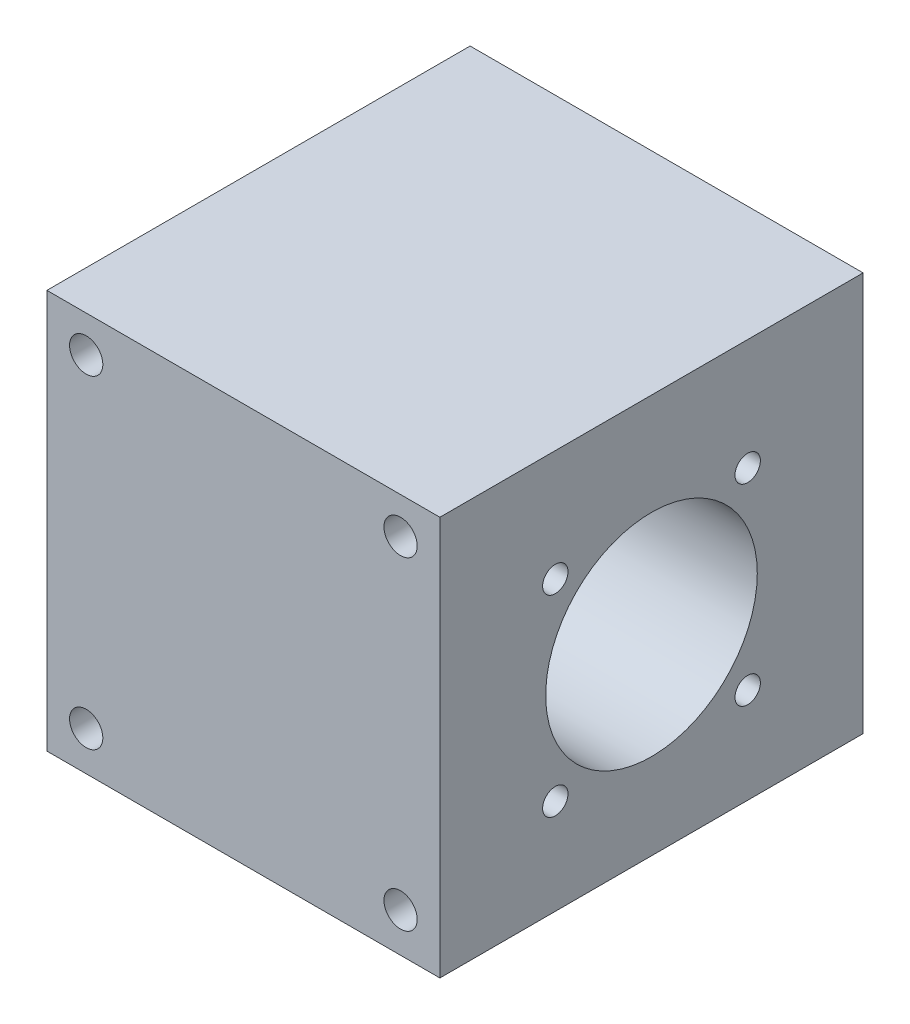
from build123d import *

# Parameters (mm, degrees)
SKETCH_1_W                  = 65
SKETCH_1_H                  = 66
EXTRUDE_1_DEPTH             = 70
SKETCH_2_R                  = 17.5
CUT_EXTRUDE_1_DEPTH         = 117.107708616
HOLE_WIZARD_1_D             = 5.5
HOLE_WIZARD_1_CBORE_D       = 9.5
HOLE_WIZARD_1_CBORE_DEPTH   = 40
HOLE_WIZARD_M5_1_AT_2_COUNT = 2
HOLE_WIZARD_M5_1_AT_2_PITCH = 31.819805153
HOLE_WIZARD_M5_1_AT_3_COUNT = 2
HOLE_WIZARD_M5_1_AT_3_PITCH = 45
HOLE_WIZARD_M5_1_AT_4_COUNT = 2
HOLE_WIZARD_M5_1_AT_4_PITCH = 31.819805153
CUT_EXTRUDE_6_DEPTH         = 0.2


with BuildPart() as part:
    # Sketch 1 → Extrude 1 (new body)
    with BuildSketch(Plane.XY):
        with Locations((32.5, 33)):
            Rectangle(SKETCH_1_W, SKETCH_1_H)
    extrude(amount=EXTRUDE_1_DEPTH)

    # Sketch 2 → Cut-Extrude 1 (cut, through all)
    with BuildSketch(Plane(origin=(65, 0, 0), x_dir=(0, 0, -1), z_dir=(1, 0, 0))):
        with Locations((-35, 31.7)):
            Circle(SKETCH_2_R)
    extrude(amount=-CUT_EXTRUDE_1_DEPTH, mode=Mode.SUBTRACT)

    # Hole Wizard 1 (through all)
    with Locations(Plane(origin=(0, 0, 0), x_dir=(-1, 0, 0), z_dir=(0, 0, -1))):
        with Locations((-58.5, 6.5), (-6.5, 6.5), (-58.5, 60), (-6.5, 60)):
            CounterBoreHole(HOLE_WIZARD_1_D / 2, HOLE_WIZARD_1_CBORE_D / 2, HOLE_WIZARD_1_CBORE_DEPTH)

    # Sketch 8 → Hole Wizard M5 _1 (revolve, cut)
    with BuildSketch(Plane(origin=(0, 47.609902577, 19.090097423), x_dir=(0, 0, 1), z_dir=(0, 1, 0))):
        Polygon((0, 0), (0, 13.6618073), (2.1, 12.4), (2.1, 0), align=None)
    hole_wizard_m5_1 = revolve(axis=Axis((-6.35, 47.609902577, 19.090097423), (1, 0, 0)), mode=Mode.SUBTRACT)

    # Hole Wizard M5 _1 at 2: Hole Wizard M5 _1 ×2
    with Locations(*[(0, 0, i * HOLE_WIZARD_M5_1_AT_2_PITCH) for i in range(1, HOLE_WIZARD_M5_1_AT_2_COUNT)]):
        add(hole_wizard_m5_1, mode=Mode.SUBTRACT)

    # Hole Wizard M5 _1 at 3: Hole Wizard M5 _1 ×2
    with Locations(*[Vector(0, -0.7071067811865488, 0.7071067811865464) * (i * HOLE_WIZARD_M5_1_AT_3_PITCH) for i in range(1, HOLE_WIZARD_M5_1_AT_3_COUNT)]):
        add(hole_wizard_m5_1, mode=Mode.SUBTRACT)

    # Hole Wizard M5 _1 at 4: Hole Wizard M5 _1 ×2
    with Locations(*[(0, -i * HOLE_WIZARD_M5_1_AT_4_PITCH, 0) for i in range(1, HOLE_WIZARD_M5_1_AT_4_COUNT)]):
        add(hole_wizard_m5_1, mode=Mode.SUBTRACT)

    # Mirror 1: Hole Wizard M5 _1 across plane
    add(hole_wizard_m5_1.mirror(Plane.ZY.offset(-32.5)), mode=Mode.SUBTRACT)

    # Mirror 1 copy 1 sketch → Mirror 1 copy 1 (revolve, cut)
    with BuildSketch(Plane(origin=(65, 47.609902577, 50.909902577), x_dir=(0, 0, 1), z_dir=(0, 1, 0))):
        Polygon((0, 0), (0, -13.6618073), (2.1, -12.4), (2.1, 0), align=None)
    revolve(axis=Axis((71.35, 47.609902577, 50.909902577), (1, 0, 0)), mode=Mode.SUBTRACT)

    # Mirror 1 copy 2 sketch → Mirror 1 copy 2 (revolve, cut)
    with BuildSketch(Plane(origin=(65, 15.790097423, 50.909902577), x_dir=(0, 0, 1), z_dir=(0, 1, 0))):
        Polygon((0, 0), (0, -13.6618073), (2.1, -12.4), (2.1, 0), align=None)
    revolve(axis=Axis((71.35, 15.790097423, 50.909902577), (1, 0, 0)), mode=Mode.SUBTRACT)

    # Mirror 1 copy 3 sketch → Mirror 1 copy 3 (revolve, cut)
    with BuildSketch(Plane(origin=(65, 15.790097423, 19.090097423), x_dir=(0, 0, 1), z_dir=(0, 1, 0))):
        Polygon((0, 0), (0, -13.6618073), (2.1, -12.4), (2.1, 0), align=None)
    revolve(axis=Axis((71.35, 15.790097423, 19.090097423), (1, 0, 0)), mode=Mode.SUBTRACT)

    # Sketch 19 → Cut-Extrude 6 (cut)
    with BuildSketch(Plane(origin=(0, 0, 0), x_dir=(-1, 0, 0), z_dir=(0, 0, -1))):
        with BuildLine():
            Line((-40.97454653, 39.999775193), (-38.89906887, 36.063667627))
            Line((-38.89906887, 36.063667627), (-44.238306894, 36.063667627))
            Line((-44.238306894, 36.063667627), (-45.699982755, 39.165892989))
            Line((-45.699982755, 39.165892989), (-46.848385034, 41.60335188))
            add(Edge.make_bspline(
                [(-46.848385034, 41.60335188), (-45.840587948, 41.60335188), (-42.525020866, 41.392010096), (-42.559152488, 42.642080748)],
                knots=[0.230769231, 0.230769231, 0.230769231, 0.230769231, 0.307692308, 0.307692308, 0.307692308, 0.307692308], degree=3))
            add(Edge.make_bspline(
                [(-42.559152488, 42.642080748), (-42.574694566, 43.213023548), (-43.402462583, 43.498494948), (-45.042532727, 43.498494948)],
                knots=[0.307692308, 0.307692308, 0.307692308, 0.307692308, 0.384615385, 0.384615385, 0.384615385, 0.384615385], degree=3))
            Line((-45.042532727, 43.498494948), (-46.9194677, 43.498494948))
            add(Edge.make_bspline(
                [(-46.9194677, 43.498494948), (-47.660763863, 41.024561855), (-48.374937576, 38.541714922), (-49.103815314, 36.063667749)],
                knots=[0.461538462, 0.461538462, 0.461538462, 0.461538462, 0.538461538, 0.538461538, 0.538461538, 0.538461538], degree=3))
            Line((-49.103815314, 36.063667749), (-54.242606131, 36.063667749))
            Line((-54.242606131, 36.063667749), (-51.492419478, 45.466548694))
            Line((-51.492419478, 45.466548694), (-43.620204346, 45.466548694))
            add(Edge.make_bspline(
                [(-43.620204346, 45.466548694), (-41.482102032, 45.466548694), (-39.893076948, 45.223589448), (-38.853357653, 44.737670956)],
                knots=[0.769230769, 0.769230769, 0.769230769, 0.769230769, 0.846153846, 0.846153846, 0.846153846, 0.846153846], degree=3))
            add(Edge.make_bspline(
                [(-38.853357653, 44.737670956), (-37.813562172, 44.251752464), (-37.282160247, 43.589614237), (-37.25930425, 42.751408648)],
                knots=[0.846153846, 0.846153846, 0.846153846, 0.846153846, 0.923076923, 0.923076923, 0.923076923, 0.923076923], degree=3))
            add(Edge.make_bspline(
                [(-37.25930425, 42.751408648), (-37.222506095, 41.402904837), (-38.460920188, 40.485693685), (-40.97454653, 39.999775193)],
                knots=[0.923076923, 0.923076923, 0.923076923, 0.923076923, 1, 1, 1, 1], degree=3))
        make_face()
        Polygon((-20.499230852, 48.809390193), (-22.48449512, 46.730820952), (-22.459668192, 46.653156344), (-19.601294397, 46.653156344), (-17.544254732, 48.809390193), align=None)
        Polygon((-20.027939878, 50.091535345), (-21.505503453, 50.091535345), (-22.534023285, 49.013342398), (-21.05645971, 49.013342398), align=None)
        Polygon((-23.174601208, 48.593020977), (-24.912571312, 48.593020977), (-26.122492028, 47.324741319), (-24.384444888, 47.324741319), align=None)
        Polygon((-31.083004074, 42.048739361), (-28.915723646, 39.347007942), (-29.866836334, 36.063667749), (-35.133163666, 36.063667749), (-34.030741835, 39.939968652), (-38.232512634, 45.466548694), (-33.824657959, 45.466548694), align=None)
        Polygon((-16.164971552, 38.733629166), (-12.689869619, 41.123452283), (-9.57734012, 36.045459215), (-14.861951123, 36.045459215), align=None)
        Polygon((-26.69031133, 46.653156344), (-22.558673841, 46.653156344), (-28.779730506, 39.816393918), (-30.804542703, 42.34061009), align=None)
        with BuildLine():
            Line((-20.097117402, 36.906520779), (-20.346933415, 36.045459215))
            Line((-20.346933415, 36.045459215), (-25.321770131, 36.045459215))
            Line((-25.321770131, 36.045459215), (-22.590249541, 45.466548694))
            Line((-22.590249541, 45.466548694), (-17.597204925, 45.466548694))
            Line((-17.597204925, 45.466548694), (-18.864341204, 41.147831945))
            Line((-18.864341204, 41.147831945), (-12.197856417, 45.4665487))
            Line((-12.197856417, 45.4665487), (-7.246790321, 45.4665487))
            add(Edge.make_bspline(
                [(-7.246790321, 45.4665487), (-11.60977155, 42.832547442), (-15.843464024, 39.413366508), (-20.097117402, 36.906520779)],
                knots=[0.875, 0.875, 0.875, 0.875, 1, 1, 1, 1], degree=3))
        make_face()
    extrude(amount=-CUT_EXTRUDE_6_DEPTH, mode=Mode.SUBTRACT)


solid = part.part
